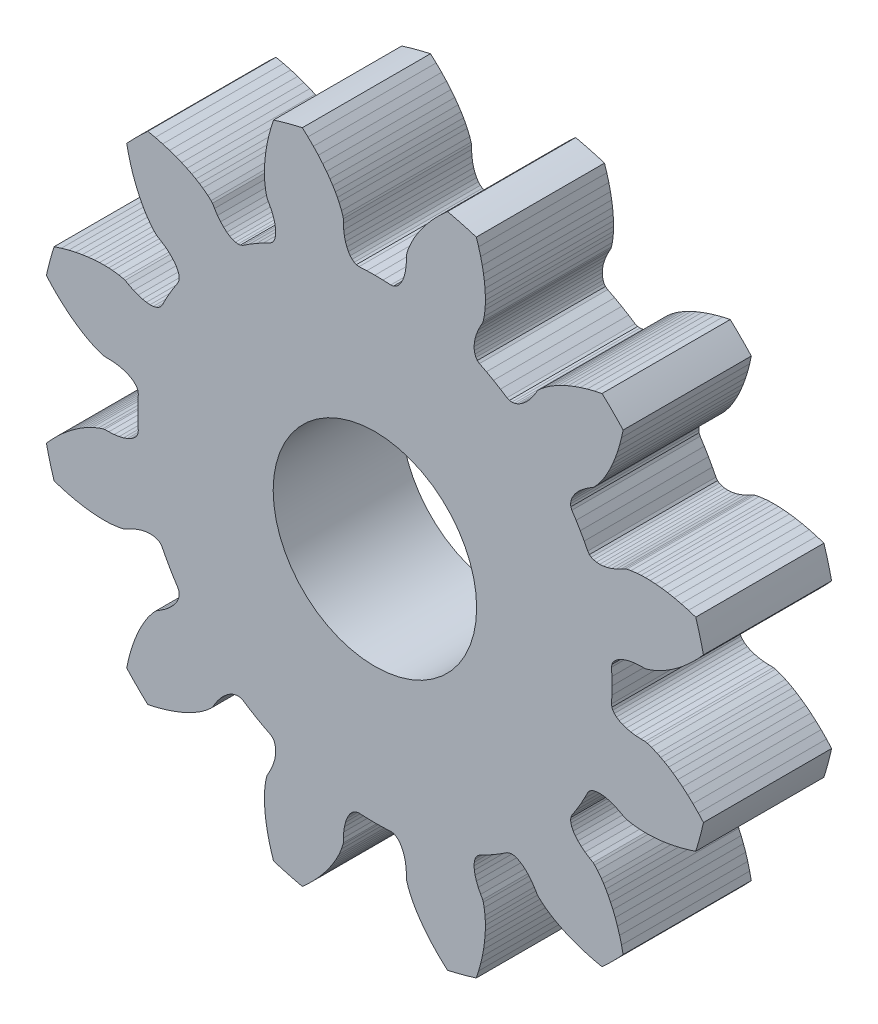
from build123d import *

# Parameters (mm, degrees)
MODEL_R                      = 2
ESTRUSIONE_ESTRUSIONE1_DEPTH = 4
SCHIZZO2_R                   = 3.175
TAGLIO_ESTRUSIONE1_DEPTH     = 95.892971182


with BuildPart() as part:
    # Model → Estrusione-Estrusione1 (new body)
    with BuildSketch(Plane.XY):
        with BuildLine():
            Line((76.3043617, -6.8550635), (76.3647108, -6.6239911))
            Line((76.3647108, -6.6239911), (76.430572, -6.4090661))
            Line((76.430572, -6.4090661), (76.5000532, -6.2121311))
            Line((76.5000532, -6.2121311), (76.5724494, -6.031365))
            Line((76.5724494, -6.031365), (76.6462805, -5.8672641))
            Line((76.6462805, -5.8672641), (76.7205127, -5.7191782))
            Line((76.7205127, -5.7191782), (76.7937921, -5.5871617))
            Line((76.7937921, -5.5871617), (76.8639516, -5.4723616))
            Line((76.8639516, -5.4723616), (76.9314562, -5.3716229))
            Line((76.9314562, -5.3716229), (77.0509509, -5.2150139))
            Line((77.0509509, -5.2150139), (77.1421575, -5.1140084))
            Line((77.1421575, -5.1140084), (77.188858, -5.0693559))
            Line((77.188858, -5.0693559), (77.3003275, -5.0040868))
            Line((77.3003275, -5.0040868), (77.4412419, -4.9106978))
            Line((77.4412419, -4.9106978), (77.5627044, -4.814937))
            Line((77.5627044, -4.814937), (77.6648021, -4.7182553))
            Line((77.6648021, -4.7182553), (77.7476939, -4.6221081))
            Line((77.7476939, -4.6221081), (77.8116355, -4.5279183))
            Line((77.8116355, -4.5279183), (77.8569496, -4.4371045))
            Line((77.8569496, -4.4371045), (77.8840639, -4.3510479))
            Line((77.8840639, -4.3510479), (77.8934894, -4.2710933))
            Line((77.8934894, -4.2710933), (77.8857937, -4.1985641))
            Line((77.8857937, -4.1985641), (77.8531264, -4.1203027))
            Line((77.8531264, -4.1203027), (77.7210663, -3.9160478))
            Line((77.7210663, -3.9160478), (77.591412, -3.7))
            Line((77.591412, -3.7), (77.4691363, -3.4796922))
            Line((77.4691363, -3.4796922), (77.3582764, -3.2631973))
            Line((77.3582764, -3.2631973), (77.3068337, -3.1957759))
            Line((77.3068337, -3.1957759), (77.2478694, -3.1528467))
            Line((77.2478694, -3.1528467), (77.1739139, -3.1210321))
            Line((77.1739139, -3.1210321), (77.0858296, -3.1014855))
            Line((77.0858296, -3.1014855), (76.9845255, -3.0953217))
            Line((76.9845255, -3.0953217), (76.8709839, -3.1036019))
            Line((76.8709839, -3.1036019), (76.7462721, -3.1273147))
            Line((76.7462721, -3.1273147), (76.6114944, -3.167393))
            Line((76.6114944, -3.167393), (76.4678319, -3.2247022))
            Line((76.4678319, -3.2247022), (76.3164975, -3.3000432))
            Line((76.3164975, -3.3000432), (76.204238, -3.3639441))
            Line((76.204238, -3.3639441), (76.1422175, -3.3820616))
            Line((76.1422175, -3.3820616), (76.0091409, -3.4105461))
            Line((76.0091409, -3.4105461), (75.8137662, -3.4357271))
            Line((75.8137662, -3.4357271), (75.6927716, -3.4438184))
            Line((75.6927716, -3.4438184), (75.5582721, -3.4471783))
            Line((75.5582721, -3.4471783), (75.4073027, -3.4446318))
            Line((75.4073027, -3.4446318), (75.2419405, -3.4348759))
            Line((75.2419405, -3.4348759), (75.0629094, -3.416765))
            Line((75.0629094, -3.416765), (74.8701632, -3.3890789))
            Line((74.8701632, -3.3890789), (74.664872, -3.3507839))
            Line((74.664872, -3.3507839), (74.4458108, -3.3003589))
            Line((74.4458108, -3.3003589), (74.2155217, -3.2370865))
            Line((74.2155217, -3.2370865), (73.9882107, -3.1643447))
            ThreePointArc((73.9882107, -3.1643447), (73.857824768, -2.717587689), (73.7473638, -2.2654918))
            Line((73.7473638, -2.2654918), (73.90785, -2.08884))
            Line((73.90785, -2.08884), (74.07565, -1.9189))
            Line((74.07565, -1.9189), (74.24015, -1.7657))
            Line((74.24015, -1.7657), (74.39879, -1.62989))
            Line((74.39879, -1.62989), (74.55187, -1.50954))
            Line((74.55187, -1.50954), (74.69786, -1.40434))
            Line((74.69786, -1.40434), (74.83619, -1.31321))
            Line((74.83619, -1.31321), (74.96566, -1.23552))
            Line((74.96566, -1.23552), (75.08382, -1.17118))
            Line((75.08382, -1.17118), (75.19265, -1.11769))
            Line((75.19265, -1.11769), (75.37444, -1.04181))
            Line((75.37444, -1.04181), (75.50393, -0.99994))
            Line((75.50393, -0.99994), (75.5667, -0.98462))
            Line((75.5667, -0.98462), (75.69587, -0.98383))
            Line((75.69587, -0.98383), (75.8646, -0.97341))
            Line((75.8646, -0.97341), (76.01767, -0.95121))
            Line((76.01767, -0.95121), (76.15443, -0.91853))
            Line((76.15443, -0.91853), (76.27429, -0.87671))
            Line((76.27429, -0.87671), (76.37676, -0.82711))
            Line((76.37676, -0.82711), (76.46141, -0.77112))
            Line((76.46141, -0.77112), (76.52792, -0.71015))
            Line((76.52792, -0.71015), (76.57606, -0.64562))
            Line((76.57606, -0.64562), (76.60566, -0.57896))
            Line((76.60566, -0.57896), (76.6165, -0.49485))
            Line((76.6165, -0.49485), (76.60426, -0.25193))
            Line((76.60426, -0.25193), (76.6, 0))
            Line((76.6, 0), (76.60426, 0.25193))
            Line((76.60426, 0.25193), (76.6165, 0.49485))
            Line((76.6165, 0.49485), (76.60566, 0.57896))
            Line((76.60566, 0.57896), (76.57606, 0.64562))
            Line((76.57606, 0.64562), (76.52792, 0.71015))
            Line((76.52792, 0.71015), (76.46141, 0.77112))
            Line((76.46141, 0.77112), (76.37676, 0.82711))
            Line((76.37676, 0.82711), (76.27429, 0.87671))
            Line((76.27429, 0.87671), (76.15443, 0.91853))
            Line((76.15443, 0.91853), (76.01767, 0.95121))
            Line((76.01767, 0.95121), (75.8646, 0.97341))
            Line((75.8646, 0.97341), (75.69587, 0.98383))
            Line((75.69587, 0.98383), (75.5667, 0.98462))
            Line((75.5667, 0.98462), (75.50393, 0.99994))
            Line((75.50393, 0.99994), (75.37444, 1.04181))
            Line((75.37444, 1.04181), (75.19265, 1.11769))
            Line((75.19265, 1.11769), (75.08382, 1.17118))
            Line((75.08382, 1.17118), (74.96566, 1.23552))
            Line((74.96566, 1.23552), (74.83619, 1.31321))
            Line((74.83619, 1.31321), (74.69786, 1.40434))
            Line((74.69786, 1.40434), (74.55187, 1.50954))
            Line((74.55187, 1.50954), (74.39879, 1.62989))
            Line((74.39879, 1.62989), (74.24015, 1.7657))
            Line((74.24015, 1.7657), (74.07565, 1.9189))
            Line((74.07565, 1.9189), (73.90785, 2.08884))
            Line((73.90785, 2.08884), (73.7473638, 2.2654918))
            ThreePointArc((73.7473638, 2.2654918), (73.857824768, 2.717587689), (73.9882107, 3.1643447))
            Line((73.9882107, 3.1643447), (74.2155217, 3.2370865))
            Line((74.2155217, 3.2370865), (74.4458108, 3.3003589))
            Line((74.4458108, 3.3003589), (74.664872, 3.3507839))
            Line((74.664872, 3.3507839), (74.8701632, 3.3890789))
            Line((74.8701632, 3.3890789), (75.0629094, 3.416765))
            Line((75.0629094, 3.416765), (75.2419405, 3.4348759))
            Line((75.2419405, 3.4348759), (75.4073027, 3.4446318))
            Line((75.4073027, 3.4446318), (75.5582721, 3.4471783))
            Line((75.5582721, 3.4471783), (75.6927716, 3.4438184))
            Line((75.6927716, 3.4438184), (75.8137662, 3.4357271))
            Line((75.8137662, 3.4357271), (76.0091409, 3.4105461))
            Line((76.0091409, 3.4105461), (76.1422175, 3.3820616))
            Line((76.1422175, 3.3820616), (76.204238, 3.3639441))
            Line((76.204238, 3.3639441), (76.3164975, 3.3000432))
            Line((76.3164975, 3.3000432), (76.4678319, 3.2247022))
            Line((76.4678319, 3.2247022), (76.6114944, 3.167393))
            Line((76.6114944, 3.167393), (76.7462721, 3.1273147))
            Line((76.7462721, 3.1273147), (76.8709839, 3.1036019))
            Line((76.8709839, 3.1036019), (76.9845255, 3.0953217))
            Line((76.9845255, 3.0953217), (77.0858296, 3.1014855))
            Line((77.0858296, 3.1014855), (77.1739139, 3.1210321))
            Line((77.1739139, 3.1210321), (77.2478694, 3.1528467))
            Line((77.2478694, 3.1528467), (77.3068337, 3.1957759))
            Line((77.3068337, 3.1957759), (77.3582764, 3.2631973))
            Line((77.3582764, 3.2631973), (77.4691363, 3.4796922))
            Line((77.4691363, 3.4796922), (77.591412, 3.7))
            Line((77.591412, 3.7), (77.7210663, 3.9160478))
            Line((77.7210663, 3.9160478), (77.8531264, 4.1203027))
            Line((77.8531264, 4.1203027), (77.8857937, 4.1985641))
            Line((77.8857937, 4.1985641), (77.8934894, 4.2710933))
            Line((77.8934894, 4.2710933), (77.8840639, 4.3510479))
            Line((77.8840639, 4.3510479), (77.8569496, 4.4371045))
            Line((77.8569496, 4.4371045), (77.8116355, 4.5279183))
            Line((77.8116355, 4.5279183), (77.7476939, 4.6221081))
            Line((77.7476939, 4.6221081), (77.6648021, 4.7182553))
            Line((77.6648021, 4.7182553), (77.5627044, 4.814937))
            Line((77.5627044, 4.814937), (77.4412419, 4.9106978))
            Line((77.4412419, 4.9106978), (77.3003275, 5.0040868))
            Line((77.3003275, 5.0040868), (77.188858, 5.0693559))
            Line((77.188858, 5.0693559), (77.1421575, 5.1140084))
            Line((77.1421575, 5.1140084), (77.0509509, 5.2150139))
            Line((77.0509509, 5.2150139), (76.9314562, 5.3716229))
            Line((76.9314562, 5.3716229), (76.8639516, 5.4723616))
            Line((76.8639516, 5.4723616), (76.7937921, 5.5871617))
            Line((76.7937921, 5.5871617), (76.7205127, 5.7191782))
            Line((76.7205127, 5.7191782), (76.6462805, 5.8672641))
            Line((76.6462805, 5.8672641), (76.5724494, 6.031365))
            Line((76.5724494, 6.031365), (76.5000532, 6.2121311))
            Line((76.5000532, 6.2121311), (76.430572, 6.4090661))
            Line((76.430572, 6.4090661), (76.3647108, 6.6239911))
            Line((76.3647108, 6.6239911), (76.3043617, 6.8550635))
            Line((76.3043617, 6.8550635), (76.2537025, 7.0882915))
            ThreePointArc((76.2537025, 7.0882915), (76.575412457, 7.424587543), (76.9117085, 7.7462975))
            Line((76.9117085, 7.7462975), (77.1449365, 7.6956383))
            Line((77.1449365, 7.6956383), (77.3760089, 7.6352892))
            Line((77.3760089, 7.6352892), (77.5909339, 7.569428))
            Line((77.5909339, 7.569428), (77.7878689, 7.4999468))
            Line((77.7878689, 7.4999468), (77.968635, 7.4275506))
            Line((77.968635, 7.4275506), (78.1327359, 7.3537195))
            Line((78.1327359, 7.3537195), (78.2808218, 7.2794873))
            Line((78.2808218, 7.2794873), (78.4128383, 7.2062079))
            Line((78.4128383, 7.2062079), (78.5276384, 7.1360484))
            Line((78.5276384, 7.1360484), (78.6283771, 7.0685438))
            Line((78.6283771, 7.0685438), (78.7849861, 6.9490491))
            Line((78.7849861, 6.9490491), (78.8859916, 6.8578425))
            Line((78.8859916, 6.8578425), (78.9306441, 6.811142))
            Line((78.9306441, 6.811142), (78.9959132, 6.6996725))
            Line((78.9959132, 6.6996725), (79.0893022, 6.5587581))
            Line((79.0893022, 6.5587581), (79.185063, 6.4372956))
            Line((79.185063, 6.4372956), (79.2817447, 6.3351979))
            Line((79.2817447, 6.3351979), (79.3778919, 6.2523061))
            Line((79.3778919, 6.2523061), (79.4720817, 6.1883645))
            Line((79.4720817, 6.1883645), (79.5628955, 6.1430504))
            Line((79.5628955, 6.1430504), (79.6489521, 6.1159361))
            Line((79.6489521, 6.1159361), (79.7289067, 6.1065106))
            Line((79.7289067, 6.1065106), (79.8014359, 6.1142063))
            Line((79.8014359, 6.1142063), (79.8796973, 6.1468736))
            Line((79.8796973, 6.1468736), (80.0839522, 6.2789337))
            Line((80.0839522, 6.2789337), (80.3, 6.408588))
            Line((80.3, 6.408588), (80.5203078, 6.5308637))
            Line((80.5203078, 6.5308637), (80.7368027, 6.6417236))
            Line((80.7368027, 6.6417236), (80.8042241, 6.6931663))
            Line((80.8042241, 6.6931663), (80.8471533, 6.7521306))
            Line((80.8471533, 6.7521306), (80.8789679, 6.8260861))
            Line((80.8789679, 6.8260861), (80.8985145, 6.9141704))
            Line((80.8985145, 6.9141704), (80.9046783, 7.0154745))
            Line((80.9046783, 7.0154745), (80.8963981, 7.1290161))
            Line((80.8963981, 7.1290161), (80.8726853, 7.2537279))
            Line((80.8726853, 7.2537279), (80.832607, 7.3885056))
            Line((80.832607, 7.3885056), (80.7752978, 7.5321681))
            Line((80.7752978, 7.5321681), (80.6999568, 7.6835025))
            Line((80.6999568, 7.6835025), (80.6360559, 7.795762))
            Line((80.6360559, 7.795762), (80.6179384, 7.8577825))
            Line((80.6179384, 7.8577825), (80.5894539, 7.9908591))
            Line((80.5894539, 7.9908591), (80.5642729, 8.1862338))
            Line((80.5642729, 8.1862338), (80.5561816, 8.3072284))
            Line((80.5561816, 8.3072284), (80.5528217, 8.4417279))
            Line((80.5528217, 8.4417279), (80.5553682, 8.5926973))
            Line((80.5553682, 8.5926973), (80.5651241, 8.7580595))
            Line((80.5651241, 8.7580595), (80.583235, 8.9370906))
            Line((80.583235, 8.9370906), (80.6109211, 9.1298368))
            Line((80.6109211, 9.1298368), (80.6492161, 9.335128))
            Line((80.6492161, 9.335128), (80.6996411, 9.5541892))
            Line((80.6996411, 9.5541892), (80.7629135, 9.7844783))
            Line((80.7629135, 9.7844783), (80.8356553, 10.0117893))
            ThreePointArc((80.8356553, 10.0117893), (81.282412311, 10.142175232), (81.7345082, 10.2526362))
            Line((81.7345082, 10.2526362), (81.91116, 10.09215))
            Line((81.91116, 10.09215), (82.0811, 9.92435))
            Line((82.0811, 9.92435), (82.2343, 9.75985))
            Line((82.2343, 9.75985), (82.37011, 9.60121))
            Line((82.37011, 9.60121), (82.49046, 9.44813))
            Line((82.49046, 9.44813), (82.59566, 9.30214))
            Line((82.59566, 9.30214), (82.68679, 9.16381))
            Line((82.68679, 9.16381), (82.76448, 9.03434))
            Line((82.76448, 9.03434), (82.82882, 8.91618))
            Line((82.82882, 8.91618), (82.88231, 8.80735))
            Line((82.88231, 8.80735), (82.95819, 8.62556))
            Line((82.95819, 8.62556), (83.00006, 8.49607))
            Line((83.00006, 8.49607), (83.01538, 8.4333))
            Line((83.01538, 8.4333), (83.01617, 8.30413))
            Line((83.01617, 8.30413), (83.02659, 8.1354))
            Line((83.02659, 8.1354), (83.04879, 7.98233))
            Line((83.04879, 7.98233), (83.08147, 7.84557))
            Line((83.08147, 7.84557), (83.12329, 7.72571))
            Line((83.12329, 7.72571), (83.17289, 7.62324))
            Line((83.17289, 7.62324), (83.22888, 7.53859))
            Line((83.22888, 7.53859), (83.28985, 7.47208))
            Line((83.28985, 7.47208), (83.35438, 7.42394))
            Line((83.35438, 7.42394), (83.42104, 7.39434))
            Line((83.42104, 7.39434), (83.50515, 7.3835))
            Line((83.50515, 7.3835), (83.74807, 7.39574))
            Line((83.74807, 7.39574), (84, 7.4))
            Line((84, 7.4), (84.25193, 7.39574))
            Line((84.25193, 7.39574), (84.49485, 7.3835))
            Line((84.49485, 7.3835), (84.57896, 7.39434))
            Line((84.57896, 7.39434), (84.64562, 7.42394))
            Line((84.64562, 7.42394), (84.71015, 7.47208))
            Line((84.71015, 7.47208), (84.77112, 7.53859))
            Line((84.77112, 7.53859), (84.82711, 7.62324))
            Line((84.82711, 7.62324), (84.87671, 7.72571))
            Line((84.87671, 7.72571), (84.91853, 7.84557))
            Line((84.91853, 7.84557), (84.95121, 7.98233))
            Line((84.95121, 7.98233), (84.97341, 8.1354))
            Line((84.97341, 8.1354), (84.98383, 8.30413))
            Line((84.98383, 8.30413), (84.98462, 8.4333))
            Line((84.98462, 8.4333), (84.99994, 8.49607))
            Line((84.99994, 8.49607), (85.04181, 8.62556))
            Line((85.04181, 8.62556), (85.11769, 8.80735))
            Line((85.11769, 8.80735), (85.17118, 8.91618))
            Line((85.17118, 8.91618), (85.23552, 9.03434))
            Line((85.23552, 9.03434), (85.31321, 9.16381))
            Line((85.31321, 9.16381), (85.40434, 9.30214))
            Line((85.40434, 9.30214), (85.50954, 9.44813))
            Line((85.50954, 9.44813), (85.62989, 9.60121))
            Line((85.62989, 9.60121), (85.7657, 9.75985))
            Line((85.7657, 9.75985), (85.9189, 9.92435))
            Line((85.9189, 9.92435), (86.08884, 10.09215))
            Line((86.08884, 10.09215), (86.2654918, 10.2526362))
            ThreePointArc((86.2654918, 10.2526362), (86.717587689, 10.142175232), (87.1643447, 10.0117893))
            Line((87.1643447, 10.0117893), (87.2370865, 9.7844783))
            Line((87.2370865, 9.7844783), (87.3003589, 9.5541892))
            Line((87.3003589, 9.5541892), (87.3507839, 9.335128))
            Line((87.3507839, 9.335128), (87.3890789, 9.1298368))
            Line((87.3890789, 9.1298368), (87.416765, 8.9370906))
            Line((87.416765, 8.9370906), (87.4348759, 8.7580595))
            Line((87.4348759, 8.7580595), (87.4446318, 8.5926973))
            Line((87.4446318, 8.5926973), (87.4471783, 8.4417279))
            Line((87.4471783, 8.4417279), (87.4438184, 8.3072284))
            Line((87.4438184, 8.3072284), (87.4357271, 8.1862338))
            Line((87.4357271, 8.1862338), (87.4105461, 7.9908591))
            Line((87.4105461, 7.9908591), (87.3820616, 7.8577825))
            Line((87.3820616, 7.8577825), (87.3639441, 7.795762))
            Line((87.3639441, 7.795762), (87.3000432, 7.6835025))
            Line((87.3000432, 7.6835025), (87.2247022, 7.5321681))
            Line((87.2247022, 7.5321681), (87.167393, 7.3885056))
            Line((87.167393, 7.3885056), (87.1273147, 7.2537279))
            Line((87.1273147, 7.2537279), (87.1036019, 7.1290161))
            Line((87.1036019, 7.1290161), (87.0953217, 7.0154745))
            Line((87.0953217, 7.0154745), (87.1014855, 6.9141704))
            Line((87.1014855, 6.9141704), (87.1210321, 6.8260861))
            Line((87.1210321, 6.8260861), (87.1528467, 6.7521306))
            Line((87.1528467, 6.7521306), (87.1957759, 6.6931663))
            Line((87.1957759, 6.6931663), (87.2631973, 6.6417236))
            Line((87.2631973, 6.6417236), (87.4796922, 6.5308637))
            Line((87.4796922, 6.5308637), (87.7, 6.408588))
            Line((87.7, 6.408588), (87.9160478, 6.2789337))
            Line((87.9160478, 6.2789337), (88.1203027, 6.1468736))
            Line((88.1203027, 6.1468736), (88.1985641, 6.1142063))
            Line((88.1985641, 6.1142063), (88.2710933, 6.1065106))
            Line((88.2710933, 6.1065106), (88.3510479, 6.1159361))
            Line((88.3510479, 6.1159361), (88.4371045, 6.1430504))
            Line((88.4371045, 6.1430504), (88.5279183, 6.1883645))
            Line((88.5279183, 6.1883645), (88.6221081, 6.2523061))
            Line((88.6221081, 6.2523061), (88.7182553, 6.3351979))
            Line((88.7182553, 6.3351979), (88.814937, 6.4372956))
            Line((88.814937, 6.4372956), (88.9106978, 6.5587581))
            Line((88.9106978, 6.5587581), (89.0040868, 6.6996725))
            Line((89.0040868, 6.6996725), (89.0693559, 6.811142))
            Line((89.0693559, 6.811142), (89.1140084, 6.8578425))
            Line((89.1140084, 6.8578425), (89.2150139, 6.9490491))
            Line((89.2150139, 6.9490491), (89.3716229, 7.0685438))
            Line((89.3716229, 7.0685438), (89.4723616, 7.1360484))
            Line((89.4723616, 7.1360484), (89.5871617, 7.2062079))
            Line((89.5871617, 7.2062079), (89.7191782, 7.2794873))
            Line((89.7191782, 7.2794873), (89.8672641, 7.3537195))
            Line((89.8672641, 7.3537195), (90.031365, 7.4275506))
            Line((90.031365, 7.4275506), (90.2121311, 7.4999468))
            Line((90.2121311, 7.4999468), (90.4090661, 7.569428))
            Line((90.4090661, 7.569428), (90.6239911, 7.6352892))
            Line((90.6239911, 7.6352892), (90.8550635, 7.6956383))
            Line((90.8550635, 7.6956383), (91.0882915, 7.7462975))
            ThreePointArc((91.0882915, 7.7462975), (91.424587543, 7.424587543), (91.7462975, 7.0882915))
            Line((91.7462975, 7.0882915), (91.6956383, 6.8550635))
            Line((91.6956383, 6.8550635), (91.6352892, 6.6239911))
            Line((91.6352892, 6.6239911), (91.569428, 6.4090661))
            Line((91.569428, 6.4090661), (91.4999468, 6.2121311))
            Line((91.4999468, 6.2121311), (91.4275506, 6.031365))
            Line((91.4275506, 6.031365), (91.3537195, 5.8672641))
            Line((91.3537195, 5.8672641), (91.2794873, 5.7191782))
            Line((91.2794873, 5.7191782), (91.2062079, 5.5871617))
            Line((91.2062079, 5.5871617), (91.1360484, 5.4723616))
            Line((91.1360484, 5.4723616), (91.0685438, 5.3716229))
            Line((91.0685438, 5.3716229), (90.9490491, 5.2150139))
            Line((90.9490491, 5.2150139), (90.8578425, 5.1140084))
            Line((90.8578425, 5.1140084), (90.811142, 5.0693559))
            Line((90.811142, 5.0693559), (90.6996725, 5.0040868))
            Line((90.6996725, 5.0040868), (90.5587581, 4.9106978))
            Line((90.5587581, 4.9106978), (90.4372956, 4.814937))
            Line((90.4372956, 4.814937), (90.3351979, 4.7182553))
            Line((90.3351979, 4.7182553), (90.2523061, 4.6221081))
            Line((90.2523061, 4.6221081), (90.1883645, 4.5279183))
            Line((90.1883645, 4.5279183), (90.1430504, 4.4371045))
            Line((90.1430504, 4.4371045), (90.1159361, 4.3510479))
            Line((90.1159361, 4.3510479), (90.1065106, 4.2710933))
            Line((90.1065106, 4.2710933), (90.1142063, 4.1985641))
            Line((90.1142063, 4.1985641), (90.1468736, 4.1203027))
            Line((90.1468736, 4.1203027), (90.2789337, 3.9160478))
            Line((90.2789337, 3.9160478), (90.408588, 3.7))
            Line((90.408588, 3.7), (90.5308637, 3.4796922))
            Line((90.5308637, 3.4796922), (90.6417236, 3.2631973))
            Line((90.6417236, 3.2631973), (90.6931663, 3.1957759))
            Line((90.6931663, 3.1957759), (90.7521306, 3.1528467))
            Line((90.7521306, 3.1528467), (90.8260861, 3.1210321))
            Line((90.8260861, 3.1210321), (90.9141704, 3.1014855))
            Line((90.9141704, 3.1014855), (91.0154745, 3.0953217))
            Line((91.0154745, 3.0953217), (91.1290161, 3.1036019))
            Line((91.1290161, 3.1036019), (91.2537279, 3.1273147))
            Line((91.2537279, 3.1273147), (91.3885056, 3.167393))
            Line((91.3885056, 3.167393), (91.5321681, 3.2247022))
            Line((91.5321681, 3.2247022), (91.6835025, 3.3000432))
            Line((91.6835025, 3.3000432), (91.795762, 3.3639441))
            Line((91.795762, 3.3639441), (91.8577825, 3.3820616))
            Line((91.8577825, 3.3820616), (91.9908591, 3.4105461))
            Line((91.9908591, 3.4105461), (92.1862338, 3.4357271))
            Line((92.1862338, 3.4357271), (92.3072284, 3.4438184))
            Line((92.3072284, 3.4438184), (92.4417279, 3.4471783))
            Line((92.4417279, 3.4471783), (92.5926973, 3.4446318))
            Line((92.5926973, 3.4446318), (92.7580595, 3.4348759))
            Line((92.7580595, 3.4348759), (92.9370906, 3.416765))
            Line((92.9370906, 3.416765), (93.1298368, 3.3890789))
            Line((93.1298368, 3.3890789), (93.335128, 3.3507839))
            Line((93.335128, 3.3507839), (93.5541892, 3.3003589))
            Line((93.5541892, 3.3003589), (93.7844783, 3.2370865))
            Line((93.7844783, 3.2370865), (94.0117893, 3.1643447))
            ThreePointArc((94.0117893, 3.1643447), (94.142175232, 2.717587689), (94.2526362, 2.2654918))
            Line((94.2526362, 2.2654918), (94.09215, 2.08884))
            Line((94.09215, 2.08884), (93.92435, 1.9189))
            Line((93.92435, 1.9189), (93.75985, 1.7657))
            Line((93.75985, 1.7657), (93.60121, 1.62989))
            Line((93.60121, 1.62989), (93.44813, 1.50954))
            Line((93.44813, 1.50954), (93.30214, 1.40434))
            Line((93.30214, 1.40434), (93.16381, 1.31321))
            Line((93.16381, 1.31321), (93.03434, 1.23552))
            Line((93.03434, 1.23552), (92.91618, 1.17118))
            Line((92.91618, 1.17118), (92.80735, 1.11769))
            Line((92.80735, 1.11769), (92.62556, 1.04181))
            Line((92.62556, 1.04181), (92.49607, 0.99994))
            Line((92.49607, 0.99994), (92.4333, 0.98462))
            Line((92.4333, 0.98462), (92.30413, 0.98383))
            Line((92.30413, 0.98383), (92.1354, 0.97341))
            Line((92.1354, 0.97341), (91.98233, 0.95121))
            Line((91.98233, 0.95121), (91.84557, 0.91853))
            Line((91.84557, 0.91853), (91.72571, 0.87671))
            Line((91.72571, 0.87671), (91.62324, 0.82711))
            Line((91.62324, 0.82711), (91.53859, 0.77112))
            Line((91.53859, 0.77112), (91.47208, 0.71015))
            Line((91.47208, 0.71015), (91.42394, 0.64562))
            Line((91.42394, 0.64562), (91.39434, 0.57896))
            Line((91.39434, 0.57896), (91.3835, 0.49485))
            Line((91.3835, 0.49485), (91.39574, 0.25193))
            Line((91.39574, 0.25193), (91.4, 0))
            Line((91.4, 0), (91.39574, -0.25193))
            Line((91.39574, -0.25193), (91.3835, -0.49485))
            Line((91.3835, -0.49485), (91.39434, -0.57896))
            Line((91.39434, -0.57896), (91.42394, -0.64562))
            Line((91.42394, -0.64562), (91.47208, -0.71015))
            Line((91.47208, -0.71015), (91.53859, -0.77112))
            Line((91.53859, -0.77112), (91.62324, -0.82711))
            Line((91.62324, -0.82711), (91.72571, -0.87671))
            Line((91.72571, -0.87671), (91.84557, -0.91853))
            Line((91.84557, -0.91853), (91.98233, -0.95121))
            Line((91.98233, -0.95121), (92.1354, -0.97341))
            Line((92.1354, -0.97341), (92.30413, -0.98383))
            Line((92.30413, -0.98383), (92.4333, -0.98462))
            Line((92.4333, -0.98462), (92.49607, -0.99994))
            Line((92.49607, -0.99994), (92.62556, -1.04181))
            Line((92.62556, -1.04181), (92.80735, -1.11769))
            Line((92.80735, -1.11769), (92.91618, -1.17118))
            Line((92.91618, -1.17118), (93.03434, -1.23552))
            Line((93.03434, -1.23552), (93.16381, -1.31321))
            Line((93.16381, -1.31321), (93.30214, -1.40434))
            Line((93.30214, -1.40434), (93.44813, -1.50954))
            Line((93.44813, -1.50954), (93.60121, -1.62989))
            Line((93.60121, -1.62989), (93.75985, -1.7657))
            Line((93.75985, -1.7657), (93.92435, -1.9189))
            Line((93.92435, -1.9189), (94.09215, -2.08884))
            Line((94.09215, -2.08884), (94.2526362, -2.2654918))
            ThreePointArc((94.2526362, -2.2654918), (94.142175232, -2.717587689), (94.0117893, -3.1643447))
            Line((94.0117893, -3.1643447), (93.7844783, -3.2370865))
            Line((93.7844783, -3.2370865), (93.5541892, -3.3003589))
            Line((93.5541892, -3.3003589), (93.335128, -3.3507839))
            Line((93.335128, -3.3507839), (93.1298368, -3.3890789))
            Line((93.1298368, -3.3890789), (92.9370906, -3.416765))
            Line((92.9370906, -3.416765), (92.7580595, -3.4348759))
            Line((92.7580595, -3.4348759), (92.5926973, -3.4446318))
            Line((92.5926973, -3.4446318), (92.4417279, -3.4471783))
            Line((92.4417279, -3.4471783), (92.3072284, -3.4438184))
            Line((92.3072284, -3.4438184), (92.1862338, -3.4357271))
            Line((92.1862338, -3.4357271), (91.9908591, -3.4105461))
            Line((91.9908591, -3.4105461), (91.8577825, -3.3820616))
            Line((91.8577825, -3.3820616), (91.795762, -3.3639441))
            Line((91.795762, -3.3639441), (91.6835025, -3.3000432))
            Line((91.6835025, -3.3000432), (91.5321681, -3.2247022))
            Line((91.5321681, -3.2247022), (91.3885056, -3.167393))
            Line((91.3885056, -3.167393), (91.2537279, -3.1273147))
            Line((91.2537279, -3.1273147), (91.1290161, -3.1036019))
            Line((91.1290161, -3.1036019), (91.0154745, -3.0953217))
            Line((91.0154745, -3.0953217), (90.9141704, -3.1014855))
            Line((90.9141704, -3.1014855), (90.8260861, -3.1210321))
            Line((90.8260861, -3.1210321), (90.7521306, -3.1528467))
            Line((90.7521306, -3.1528467), (90.6931663, -3.1957759))
            Line((90.6931663, -3.1957759), (90.6417236, -3.2631973))
            Line((90.6417236, -3.2631973), (90.5308637, -3.4796922))
            Line((90.5308637, -3.4796922), (90.408588, -3.7))
            Line((90.408588, -3.7), (90.2789337, -3.9160478))
            Line((90.2789337, -3.9160478), (90.1468736, -4.1203027))
            Line((90.1468736, -4.1203027), (90.1142063, -4.1985641))
            Line((90.1142063, -4.1985641), (90.1065106, -4.2710933))
            Line((90.1065106, -4.2710933), (90.1159361, -4.3510479))
            Line((90.1159361, -4.3510479), (90.1430504, -4.4371045))
            Line((90.1430504, -4.4371045), (90.1883645, -4.5279183))
            Line((90.1883645, -4.5279183), (90.2523061, -4.6221081))
            Line((90.2523061, -4.6221081), (90.3351979, -4.7182553))
            Line((90.3351979, -4.7182553), (90.4372956, -4.814937))
            Line((90.4372956, -4.814937), (90.5587581, -4.9106978))
            Line((90.5587581, -4.9106978), (90.6996725, -5.0040868))
            Line((90.6996725, -5.0040868), (90.811142, -5.0693559))
            Line((90.811142, -5.0693559), (90.8578425, -5.1140084))
            Line((90.8578425, -5.1140084), (90.9490491, -5.2150139))
            Line((90.9490491, -5.2150139), (91.0685438, -5.3716229))
            Line((91.0685438, -5.3716229), (91.1360484, -5.4723616))
            Line((91.1360484, -5.4723616), (91.2062079, -5.5871617))
            Line((91.2062079, -5.5871617), (91.2794873, -5.7191782))
            Line((91.2794873, -5.7191782), (91.3537195, -5.8672641))
            Line((91.3537195, -5.8672641), (91.4275506, -6.031365))
            Line((91.4275506, -6.031365), (91.4999468, -6.2121311))
            Line((91.4999468, -6.2121311), (91.569428, -6.4090661))
            Line((91.569428, -6.4090661), (91.6352892, -6.6239911))
            Line((91.6352892, -6.6239911), (91.6956383, -6.8550635))
            Line((91.6956383, -6.8550635), (91.7462975, -7.0882915))
            ThreePointArc((91.7462975, -7.0882915), (91.424587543, -7.424587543), (91.0882915, -7.7462975))
            Line((91.0882915, -7.7462975), (90.8550635, -7.6956383))
            Line((90.8550635, -7.6956383), (90.6239911, -7.6352892))
            Line((90.6239911, -7.6352892), (90.4090661, -7.569428))
            Line((90.4090661, -7.569428), (90.2121311, -7.4999468))
            Line((90.2121311, -7.4999468), (90.031365, -7.4275506))
            Line((90.031365, -7.4275506), (89.8672641, -7.3537195))
            Line((89.8672641, -7.3537195), (89.7191782, -7.2794873))
            Line((89.7191782, -7.2794873), (89.5871617, -7.2062079))
            Line((89.5871617, -7.2062079), (89.4723616, -7.1360484))
            Line((89.4723616, -7.1360484), (89.3716229, -7.0685438))
            Line((89.3716229, -7.0685438), (89.2150139, -6.9490491))
            Line((89.2150139, -6.9490491), (89.1140084, -6.8578425))
            Line((89.1140084, -6.8578425), (89.0693559, -6.811142))
            Line((89.0693559, -6.811142), (89.0040868, -6.6996725))
            Line((89.0040868, -6.6996725), (88.9106978, -6.5587581))
            Line((88.9106978, -6.5587581), (88.814937, -6.4372956))
            Line((88.814937, -6.4372956), (88.7182553, -6.3351979))
            Line((88.7182553, -6.3351979), (88.6221081, -6.2523061))
            Line((88.6221081, -6.2523061), (88.5279183, -6.1883645))
            Line((88.5279183, -6.1883645), (88.4371045, -6.1430504))
            Line((88.4371045, -6.1430504), (88.3510479, -6.1159361))
            Line((88.3510479, -6.1159361), (88.2710933, -6.1065106))
            Line((88.2710933, -6.1065106), (88.1985641, -6.1142063))
            Line((88.1985641, -6.1142063), (88.1203027, -6.1468736))
            Line((88.1203027, -6.1468736), (87.9160478, -6.2789337))
            Line((87.9160478, -6.2789337), (87.7, -6.408588))
            Line((87.7, -6.408588), (87.4796922, -6.5308637))
            Line((87.4796922, -6.5308637), (87.2631973, -6.6417236))
            Line((87.2631973, -6.6417236), (87.1957759, -6.6931663))
            Line((87.1957759, -6.6931663), (87.1528467, -6.7521306))
            Line((87.1528467, -6.7521306), (87.1210321, -6.8260861))
            Line((87.1210321, -6.8260861), (87.1014855, -6.9141704))
            Line((87.1014855, -6.9141704), (87.0953217, -7.0154745))
            Line((87.0953217, -7.0154745), (87.1036019, -7.1290161))
            Line((87.1036019, -7.1290161), (87.1273147, -7.2537279))
            Line((87.1273147, -7.2537279), (87.167393, -7.3885056))
            Line((87.167393, -7.3885056), (87.2247022, -7.5321681))
            Line((87.2247022, -7.5321681), (87.3000432, -7.6835025))
            Line((87.3000432, -7.6835025), (87.3639441, -7.795762))
            Line((87.3639441, -7.795762), (87.3820616, -7.8577825))
            Line((87.3820616, -7.8577825), (87.4105461, -7.9908591))
            Line((87.4105461, -7.9908591), (87.4357271, -8.1862338))
            Line((87.4357271, -8.1862338), (87.4438184, -8.3072284))
            Line((87.4438184, -8.3072284), (87.4471783, -8.4417279))
            Line((87.4471783, -8.4417279), (87.4446318, -8.5926973))
            Line((87.4446318, -8.5926973), (87.4348759, -8.7580595))
            Line((87.4348759, -8.7580595), (87.416765, -8.9370906))
            Line((87.416765, -8.9370906), (87.3890789, -9.1298368))
            Line((87.3890789, -9.1298368), (87.3507839, -9.335128))
            Line((87.3507839, -9.335128), (87.3003589, -9.5541892))
            Line((87.3003589, -9.5541892), (87.2370865, -9.7844783))
            Line((87.2370865, -9.7844783), (87.1643447, -10.0117893))
            ThreePointArc((87.1643447, -10.0117893), (86.717587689, -10.142175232), (86.2654918, -10.2526362))
            Line((86.2654918, -10.2526362), (86.08884, -10.09215))
            Line((86.08884, -10.09215), (85.9189, -9.92435))
            Line((85.9189, -9.92435), (85.7657, -9.75985))
            Line((85.7657, -9.75985), (85.62989, -9.60121))
            Line((85.62989, -9.60121), (85.50954, -9.44813))
            Line((85.50954, -9.44813), (85.40434, -9.30214))
            Line((85.40434, -9.30214), (85.31321, -9.16381))
            Line((85.31321, -9.16381), (85.23552, -9.03434))
            Line((85.23552, -9.03434), (85.17118, -8.91618))
            Line((85.17118, -8.91618), (85.11769, -8.80735))
            Line((85.11769, -8.80735), (85.04181, -8.62556))
            Line((85.04181, -8.62556), (84.99994, -8.49607))
            Line((84.99994, -8.49607), (84.98462, -8.4333))
            Line((84.98462, -8.4333), (84.98383, -8.30413))
            Line((84.98383, -8.30413), (84.97341, -8.1354))
            Line((84.97341, -8.1354), (84.95121, -7.98233))
            Line((84.95121, -7.98233), (84.91853, -7.84557))
            Line((84.91853, -7.84557), (84.87671, -7.72571))
            Line((84.87671, -7.72571), (84.82711, -7.62324))
            Line((84.82711, -7.62324), (84.77112, -7.53859))
            Line((84.77112, -7.53859), (84.71015, -7.47208))
            Line((84.71015, -7.47208), (84.64562, -7.42394))
            Line((84.64562, -7.42394), (84.57896, -7.39434))
            Line((84.57896, -7.39434), (84.49485, -7.3835))
            Line((84.49485, -7.3835), (84.25193, -7.39574))
            Line((84.25193, -7.39574), (84, -7.4))
            Line((84, -7.4), (83.74807, -7.39574))
            Line((83.74807, -7.39574), (83.50515, -7.3835))
            Line((83.50515, -7.3835), (83.42104, -7.39434))
            Line((83.42104, -7.39434), (83.35438, -7.42394))
            Line((83.35438, -7.42394), (83.28985, -7.47208))
            Line((83.28985, -7.47208), (83.22888, -7.53859))
            Line((83.22888, -7.53859), (83.17289, -7.62324))
            Line((83.17289, -7.62324), (83.12329, -7.72571))
            Line((83.12329, -7.72571), (83.08147, -7.84557))
            Line((83.08147, -7.84557), (83.04879, -7.98233))
            Line((83.04879, -7.98233), (83.02659, -8.1354))
            Line((83.02659, -8.1354), (83.01617, -8.30413))
            Line((83.01617, -8.30413), (83.01538, -8.4333))
            Line((83.01538, -8.4333), (83.00006, -8.49607))
            Line((83.00006, -8.49607), (82.95819, -8.62556))
            Line((82.95819, -8.62556), (82.88231, -8.80735))
            Line((82.88231, -8.80735), (82.82882, -8.91618))
            Line((82.82882, -8.91618), (82.76448, -9.03434))
            Line((82.76448, -9.03434), (82.68679, -9.16381))
            Line((82.68679, -9.16381), (82.59566, -9.30214))
            Line((82.59566, -9.30214), (82.49046, -9.44813))
            Line((82.49046, -9.44813), (82.37011, -9.60121))
            Line((82.37011, -9.60121), (82.2343, -9.75985))
            Line((82.2343, -9.75985), (82.0811, -9.92435))
            Line((82.0811, -9.92435), (81.91116, -10.09215))
            Line((81.91116, -10.09215), (81.7345082, -10.2526362))
            ThreePointArc((81.7345082, -10.2526362), (81.282412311, -10.142175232), (80.8356553, -10.0117893))
            Line((80.8356553, -10.0117893), (80.7629135, -9.7844783))
            Line((80.7629135, -9.7844783), (80.6996411, -9.5541892))
            Line((80.6996411, -9.5541892), (80.6492161, -9.335128))
            Line((80.6492161, -9.335128), (80.6109211, -9.1298368))
            Line((80.6109211, -9.1298368), (80.583235, -8.9370906))
            Line((80.583235, -8.9370906), (80.5651241, -8.7580595))
            Line((80.5651241, -8.7580595), (80.5553682, -8.5926973))
            Line((80.5553682, -8.5926973), (80.5528217, -8.4417279))
            Line((80.5528217, -8.4417279), (80.5561816, -8.3072284))
            Line((80.5561816, -8.3072284), (80.5642729, -8.1862338))
            Line((80.5642729, -8.1862338), (80.5894539, -7.9908591))
            Line((80.5894539, -7.9908591), (80.6179384, -7.8577825))
            Line((80.6179384, -7.8577825), (80.6360559, -7.795762))
            Line((80.6360559, -7.795762), (80.6999568, -7.6835025))
            Line((80.6999568, -7.6835025), (80.7752978, -7.5321681))
            Line((80.7752978, -7.5321681), (80.832607, -7.3885056))
            Line((80.832607, -7.3885056), (80.8726853, -7.2537279))
            Line((80.8726853, -7.2537279), (80.8963981, -7.1290161))
            Line((80.8963981, -7.1290161), (80.9046783, -7.0154745))
            Line((80.9046783, -7.0154745), (80.8985145, -6.9141704))
            Line((80.8985145, -6.9141704), (80.8789679, -6.8260861))
            Line((80.8789679, -6.8260861), (80.8471533, -6.7521306))
            Line((80.8471533, -6.7521306), (80.8042241, -6.6931663))
            Line((80.8042241, -6.6931663), (80.7368027, -6.6417236))
            Line((80.7368027, -6.6417236), (80.5203078, -6.5308637))
            Line((80.5203078, -6.5308637), (80.3, -6.408588))
            Line((80.3, -6.408588), (80.0839522, -6.2789337))
            Line((80.0839522, -6.2789337), (79.8796973, -6.1468736))
            Line((79.8796973, -6.1468736), (79.8014359, -6.1142063))
            Line((79.8014359, -6.1142063), (79.7289067, -6.1065106))
            Line((79.7289067, -6.1065106), (79.6489521, -6.1159361))
            Line((79.6489521, -6.1159361), (79.5628955, -6.1430504))
            Line((79.5628955, -6.1430504), (79.4720817, -6.1883645))
            Line((79.4720817, -6.1883645), (79.3778919, -6.2523061))
            Line((79.3778919, -6.2523061), (79.2817447, -6.3351979))
            Line((79.2817447, -6.3351979), (79.185063, -6.4372956))
            Line((79.185063, -6.4372956), (79.0893022, -6.5587581))
            Line((79.0893022, -6.5587581), (78.9959132, -6.6996725))
            Line((78.9959132, -6.6996725), (78.9306441, -6.811142))
            Line((78.9306441, -6.811142), (78.8859916, -6.8578425))
            Line((78.8859916, -6.8578425), (78.7849861, -6.9490491))
            Line((78.7849861, -6.9490491), (78.6283771, -7.0685438))
            Line((78.6283771, -7.0685438), (78.5276384, -7.1360484))
            Line((78.5276384, -7.1360484), (78.4128383, -7.2062079))
            Line((78.4128383, -7.2062079), (78.2808218, -7.2794873))
            Line((78.2808218, -7.2794873), (78.1327359, -7.3537195))
            Line((78.1327359, -7.3537195), (77.968635, -7.4275506))
            Line((77.968635, -7.4275506), (77.7878689, -7.4999468))
            Line((77.7878689, -7.4999468), (77.5909339, -7.569428))
            Line((77.5909339, -7.569428), (77.3760089, -7.6352892))
            Line((77.3760089, -7.6352892), (77.1449365, -7.6956383))
            Line((77.1449365, -7.6956383), (76.9117085, -7.7462975))
            ThreePointArc((76.9117085, -7.7462975), (76.575412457, -7.424587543), (76.2537025, -7.0882915))
            Line((76.2537025, -7.0882915), (76.3043617, -6.8550635))
        make_face()
        with Locations((84, 0)):
            Circle(MODEL_R, mode=Mode.SUBTRACT)
    extrude(amount=ESTRUSIONE_ESTRUSIONE1_DEPTH)

    # Schizzo2 → Taglio-Estrusione1 (cut, through all)
    with BuildSketch(Plane(origin=(0, 0, 0), x_dir=(-1, 0, 0), z_dir=(0, 0, -1))):
        with Locations((-84, 0)):
            Circle(SCHIZZO2_R)
    extrude(amount=-TAGLIO_ESTRUSIONE1_DEPTH, mode=Mode.SUBTRACT)


solid = part.part
